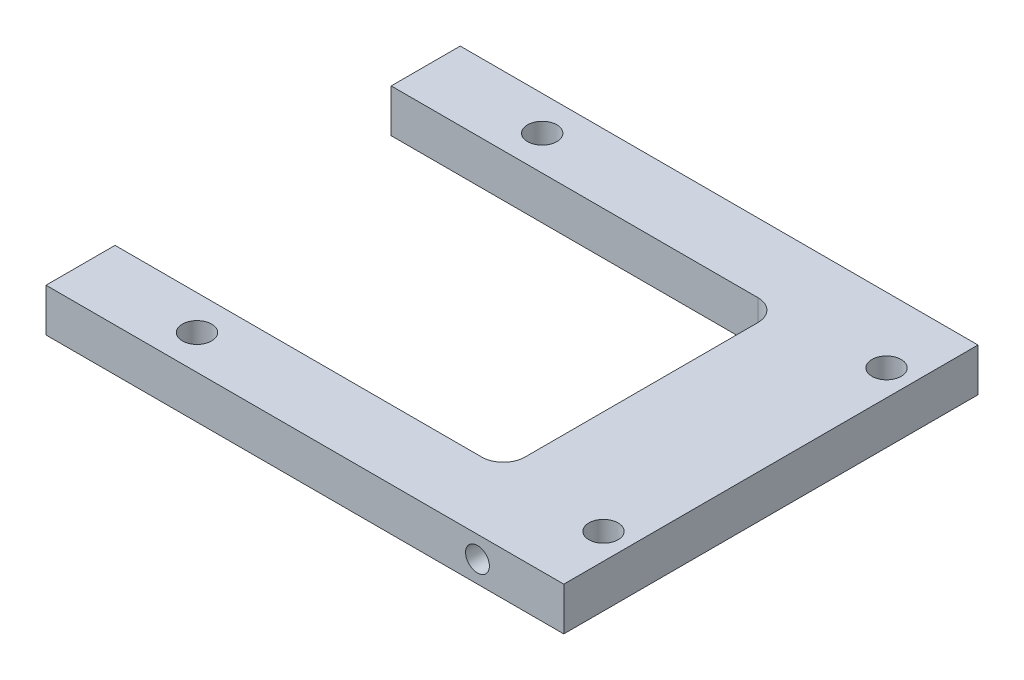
ISO-10303-21;
HEADER;
FILE_DESCRIPTION(('STEP AP214'),'2;1');
FILE_NAME('part.step','',(''),(''),'','','');
FILE_SCHEMA(('AUTOMOTIVE_DESIGN { 1 0 10303 214 1 1 1 1 }'));
ENDSEC;
DATA;
#1=APPLICATION_CONTEXT('core data for automotive mechanical design processes');
#2=APPLICATION_PROTOCOL_DEFINITION('international standard','automotive_design',2000,#1);
#3=PRODUCT_CONTEXT('',#1,'mechanical');
#4=PRODUCT('Part','Part','',(#3));
#5=PRODUCT_RELATED_PRODUCT_CATEGORY('part','',(#4));
#6=PRODUCT_DEFINITION_FORMATION('','',#4);
#7=PRODUCT_DEFINITION_CONTEXT('part definition',#1,'design');
#8=PRODUCT_DEFINITION('design','',#6,#7);
#9=PRODUCT_DEFINITION_SHAPE('','',#8);
#10=(LENGTH_UNIT() NAMED_UNIT(*) SI_UNIT(.MILLI.,.METRE.));
#11=(NAMED_UNIT(*) PLANE_ANGLE_UNIT() SI_UNIT($,.RADIAN.));
#12=(NAMED_UNIT(*) SI_UNIT($,.STERADIAN.) SOLID_ANGLE_UNIT());
#13=UNCERTAINTY_MEASURE_WITH_UNIT(LENGTH_MEASURE(1.E-05),#10,'distance_accuracy_value','');
#14=(GEOMETRIC_REPRESENTATION_CONTEXT(3) GLOBAL_UNCERTAINTY_ASSIGNED_CONTEXT((#13)) GLOBAL_UNIT_ASSIGNED_CONTEXT((#10,
#11,#12)) REPRESENTATION_CONTEXT('',''));
#15=CARTESIAN_POINT('',(0.,0.,0.));
#16=DIRECTION('',(0.,0.,1.));
#17=DIRECTION('',(1.,0.,0.));
#18=AXIS2_PLACEMENT_3D('',#15,#16,#17);
#19=CARTESIAN_POINT('',(-43.7302590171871,6.35,-31.8783006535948));
#20=DIRECTION('',(1.,0.,0.));
#21=DIRECTION('',(0.,0.,-1.));
#22=AXIS2_PLACEMENT_3D('',#19,#20,#21);
#23=PLANE('',#22);
#24=DIRECTION('',(0.,0.,1.));
#25=VECTOR('',#24,1.);
#26=CARTESIAN_POINT('',(-43.7302590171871,0.,-31.8783006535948));
#27=LINE('',#26,#25);
#28=CARTESIAN_POINT('',(-43.7302590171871,0.,-31.8783006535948));
#29=VERTEX_POINT('',#28);
#30=CARTESIAN_POINT('',(-43.7302590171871,0.,-21.7183006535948));
#31=VERTEX_POINT('',#30);
#32=EDGE_CURVE('E151',#29,#31,#27,.T.);
#33=ORIENTED_EDGE('',*,*,#32,.T.);
#34=DIRECTION('',(0.,-1.,0.));
#35=VECTOR('',#34,1.);
#36=CARTESIAN_POINT('',(-43.7302590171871,136.525,-21.7183006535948));
#37=LINE('',#36,#35);
#38=CARTESIAN_POINT('',(-43.7302590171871,6.34999999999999,-21.7183006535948));
#39=VERTEX_POINT('',#38);
#40=EDGE_CURVE('E118',#39,#31,#37,.T.);
#41=ORIENTED_EDGE('',*,*,#40,.F.);
#42=DIRECTION('',(0.,0.,1.));
#43=VECTOR('',#42,1.);
#44=CARTESIAN_POINT('',(-43.7302590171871,6.35,-31.8783006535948));
#45=LINE('',#44,#43);
#46=CARTESIAN_POINT('',(-43.7302590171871,6.35,-31.8783006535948));
#47=VERTEX_POINT('',#46);
#48=EDGE_CURVE('E134',#47,#39,#45,.T.);
#49=ORIENTED_EDGE('',*,*,#48,.F.);
#50=DIRECTION('',(0.,-1.,0.));
#51=VECTOR('',#50,1.);
#52=CARTESIAN_POINT('',(-43.7302590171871,6.35,-31.8783006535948));
#53=LINE('',#52,#51);
#54=EDGE_CURVE('E150',#47,#29,#53,.T.);
#55=ORIENTED_EDGE('',*,*,#54,.T.);
#56=EDGE_LOOP('',(#33,#41,#49,#55));
#57=FACE_BOUND('',#56,.T.);
#58=ADVANCED_FACE('F32',(#57),#23,.F.);
#59=CARTESIAN_POINT('',(-43.7302590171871,6.34999999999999,18.9216993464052));
#60=VERTEX_POINT('',#59);
#61=CARTESIAN_POINT('',(-43.7302590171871,6.35,29.0816993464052));
#62=VERTEX_POINT('',#61);
#63=EDGE_CURVE('E123',#60,#62,#45,.T.);
#64=ORIENTED_EDGE('',*,*,#63,.F.);
#65=DIRECTION('',(0.,-1.,0.));
#66=VECTOR('',#65,1.);
#67=CARTESIAN_POINT('',(-43.7302590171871,136.525,18.9216993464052));
#68=LINE('',#67,#66);
#69=CARTESIAN_POINT('',(-43.7302590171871,0.,18.9216993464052));
#70=VERTEX_POINT('',#69);
#71=EDGE_CURVE('E107',#60,#70,#68,.T.);
#72=ORIENTED_EDGE('',*,*,#71,.T.);
#73=CARTESIAN_POINT('',(-43.7302590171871,0.,29.0816993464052));
#74=VERTEX_POINT('',#73);
#75=EDGE_CURVE('E155',#70,#74,#27,.T.);
#76=ORIENTED_EDGE('',*,*,#75,.T.);
#77=DIRECTION('',(0.,-1.,0.));
#78=VECTOR('',#77,1.);
#79=CARTESIAN_POINT('',(-43.7302590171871,6.35,29.0816993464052));
#80=LINE('',#79,#78);
#81=EDGE_CURVE('E133',#62,#74,#80,.T.);
#82=ORIENTED_EDGE('',*,*,#81,.F.);
#83=EDGE_LOOP('',(#64,#72,#76,#82));
#84=FACE_BOUND('',#83,.T.);
#85=ADVANCED_FACE('F131',(#84),#23,.F.);
#86=CARTESIAN_POINT('',(-43.7302590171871,6.35,29.0816993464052));
#87=DIRECTION('',(0.,0.,-1.));
#88=DIRECTION('',(-1.,0.,0.));
#89=AXIS2_PLACEMENT_3D('',#86,#87,#88);
#90=PLANE('',#89);
#91=CARTESIAN_POINT('',(19.7697409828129,3.175,29.0816993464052));
#92=DIRECTION('',(0.,0.,1.));
#93=DIRECTION('',(1.,0.,0.));
#94=AXIS2_PLACEMENT_3D('',#91,#92,#93);
#95=CIRCLE('',#94,1.7526);
#96=CARTESIAN_POINT('',(21.5223409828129,3.175,29.0816993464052));
#97=VERTEX_POINT('',#96);
#98=EDGE_CURVE('E360',#97,#97,#95,.T.);
#99=ORIENTED_EDGE('',*,*,#98,.F.);
#100=EDGE_LOOP('',(#99));
#101=FACE_BOUND('',#100,.T.);
#102=DIRECTION('',(1.,0.,0.));
#103=VECTOR('',#102,1.);
#104=CARTESIAN_POINT('',(-43.7302590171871,0.,29.0816993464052));
#105=LINE('',#104,#103);
#106=CARTESIAN_POINT('',(32.4697409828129,0.,29.0816993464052));
#107=VERTEX_POINT('',#106);
#108=EDGE_CURVE('E154',#74,#107,#105,.T.);
#109=ORIENTED_EDGE('',*,*,#108,.T.);
#110=DIRECTION('',(0.,-1.,0.));
#111=VECTOR('',#110,1.);
#112=CARTESIAN_POINT('',(32.4697409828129,6.35,29.0816993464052));
#113=LINE('',#112,#111);
#114=CARTESIAN_POINT('',(32.4697409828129,6.35,29.0816993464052));
#115=VERTEX_POINT('',#114);
#116=EDGE_CURVE('E163',#115,#107,#113,.T.);
#117=ORIENTED_EDGE('',*,*,#116,.F.);
#118=DIRECTION('',(1.,0.,0.));
#119=VECTOR('',#118,1.);
#120=CARTESIAN_POINT('',(-43.7302590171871,6.35,29.0816993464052));
#121=LINE('',#120,#119);
#122=EDGE_CURVE('E138',#62,#115,#121,.T.);
#123=ORIENTED_EDGE('',*,*,#122,.F.);
#124=ORIENTED_EDGE('',*,*,#81,.T.);
#125=EDGE_LOOP('',(#109,#117,#123,#124));
#126=FACE_BOUND('',#125,.T.);
#127=ADVANCED_FACE('F204',(#101,#126),#90,.F.);
#128=CARTESIAN_POINT('',(32.4697409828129,6.35,-31.8783006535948));
#129=DIRECTION('',(-1.,0.,0.));
#130=DIRECTION('',(0.,0.,1.));
#131=AXIS2_PLACEMENT_3D('',#128,#129,#130);
#132=PLANE('',#131);
#133=DIRECTION('',(0.,0.,-1.));
#134=VECTOR('',#133,1.);
#135=CARTESIAN_POINT('',(32.4697409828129,0.,-31.8783006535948));
#136=LINE('',#135,#134);
#137=CARTESIAN_POINT('',(32.4697409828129,0.,-31.8783006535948));
#138=VERTEX_POINT('',#137);
#139=EDGE_CURVE('E139',#107,#138,#136,.T.);
#140=ORIENTED_EDGE('',*,*,#139,.T.);
#141=DIRECTION('',(0.,-1.,0.));
#142=VECTOR('',#141,1.);
#143=CARTESIAN_POINT('',(32.4697409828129,6.35,-31.8783006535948));
#144=LINE('',#143,#142);
#145=CARTESIAN_POINT('',(32.4697409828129,6.35,-31.8783006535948));
#146=VERTEX_POINT('',#145);
#147=EDGE_CURVE('E160',#146,#138,#144,.T.);
#148=ORIENTED_EDGE('',*,*,#147,.F.);
#149=DIRECTION('',(0.,0.,-1.));
#150=VECTOR('',#149,1.);
#151=CARTESIAN_POINT('',(32.4697409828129,6.35,-31.8783006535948));
#152=LINE('',#151,#150);
#153=EDGE_CURVE('E146',#115,#146,#152,.T.);
#154=ORIENTED_EDGE('',*,*,#153,.F.);
#155=ORIENTED_EDGE('',*,*,#116,.T.);
#156=EDGE_LOOP('',(#140,#148,#154,#155));
#157=FACE_BOUND('',#156,.T.);
#158=ADVANCED_FACE('F208',(#157),#132,.F.);
#159=CARTESIAN_POINT('',(-43.7302590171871,6.35,-31.8783006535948));
#160=DIRECTION('',(0.,0.,1.));
#161=DIRECTION('',(1.,0.,0.));
#162=AXIS2_PLACEMENT_3D('',#159,#160,#161);
#163=PLANE('',#162);
#164=DIRECTION('',(-1.,0.,0.));
#165=VECTOR('',#164,1.);
#166=CARTESIAN_POINT('',(-43.7302590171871,0.,-31.8783006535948));
#167=LINE('',#166,#165);
#168=EDGE_CURVE('E135',#138,#29,#167,.T.);
#169=ORIENTED_EDGE('',*,*,#168,.T.);
#170=ORIENTED_EDGE('',*,*,#54,.F.);
#171=DIRECTION('',(-1.,0.,0.));
#172=VECTOR('',#171,1.);
#173=CARTESIAN_POINT('',(-43.7302590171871,6.35,-31.8783006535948));
#174=LINE('',#173,#172);
#175=EDGE_CURVE('E148',#146,#47,#174,.T.);
#176=ORIENTED_EDGE('',*,*,#175,.F.);
#177=ORIENTED_EDGE('',*,*,#147,.T.);
#178=EDGE_LOOP('',(#169,#170,#176,#177));
#179=FACE_BOUND('',#178,.T.);
#180=ADVANCED_FACE('F212',(#179),#163,.F.);
#181=CARTESIAN_POINT('',(-43.7302590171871,6.35,29.0816993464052));
#182=DIRECTION('',(0.,1.,0.));
#183=DIRECTION('',(0.,0.,1.));
#184=AXIS2_PLACEMENT_3D('',#181,#182,#183);
#185=PLANE('',#184);
#186=DIRECTION('',(-1.,0.,0.));
#187=VECTOR('',#186,1.);
#188=CARTESIAN_POINT('',(-43.7302590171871,6.35,-21.7183006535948));
#189=LINE('',#188,#187);
#190=CARTESIAN_POINT('',(10.2447409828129,6.35,-21.7183006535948));
#191=VERTEX_POINT('',#190);
#192=EDGE_CURVE('E358',#191,#39,#189,.T.);
#193=ORIENTED_EDGE('',*,*,#192,.F.);
#194=CARTESIAN_POINT('',(10.2447409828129,6.34999999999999,-18.5433006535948));
#195=DIRECTION('',(0.,1.,0.));
#196=DIRECTION('',(0.,0.,1.));
#197=AXIS2_PLACEMENT_3D('',#194,#195,#196);
#198=CIRCLE('',#197,3.175);
#199=CARTESIAN_POINT('',(13.4197409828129,6.35,-18.5433006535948));
#200=VERTEX_POINT('',#199);
#201=EDGE_CURVE('E11',#191,#200,#198,.F.);
#202=ORIENTED_EDGE('',*,*,#201,.T.);
#203=DIRECTION('',(0.,0.,-1.));
#204=VECTOR('',#203,1.);
#205=CARTESIAN_POINT('',(13.4197409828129,6.35,29.0816993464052));
#206=LINE('',#205,#204);
#207=CARTESIAN_POINT('',(13.4197409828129,6.35,15.7466993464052));
#208=VERTEX_POINT('',#207);
#209=EDGE_CURVE('E128',#208,#200,#206,.T.);
#210=ORIENTED_EDGE('',*,*,#209,.F.);
#211=CARTESIAN_POINT('',(10.2447409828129,6.34999999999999,15.7466993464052));
#212=DIRECTION('',(0.,1.,0.));
#213=DIRECTION('',(0.,0.,1.));
#214=AXIS2_PLACEMENT_3D('',#211,#212,#213);
#215=CIRCLE('',#214,3.175);
#216=CARTESIAN_POINT('',(10.2447409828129,6.35,18.9216993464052));
#217=VERTEX_POINT('',#216);
#218=EDGE_CURVE('E127',#208,#217,#215,.F.);
#219=ORIENTED_EDGE('',*,*,#218,.T.);
#220=DIRECTION('',(1.,0.,0.));
#221=VECTOR('',#220,1.);
#222=CARTESIAN_POINT('',(-43.7302590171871,6.35,18.9216993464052));
#223=LINE('',#222,#221);
#224=EDGE_CURVE('E111',#60,#217,#223,.T.);
#225=ORIENTED_EDGE('',*,*,#224,.F.);
#226=ORIENTED_EDGE('',*,*,#63,.T.);
#227=ORIENTED_EDGE('',*,*,#122,.T.);
#228=ORIENTED_EDGE('',*,*,#153,.T.);
#229=ORIENTED_EDGE('',*,*,#175,.T.);
#230=ORIENTED_EDGE('',*,*,#48,.T.);
#231=EDGE_LOOP('',(#193,#202,#210,#219,#225,#226,#227,#228,#229,#230));
#232=FACE_BOUND('',#231,.T.);
#233=CARTESIAN_POINT('',(28.6597409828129,6.35,-22.2263006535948));
#234=DIRECTION('',(0.,1.,0.));
#235=DIRECTION('',(0.,0.,-1.));
#236=AXIS2_PLACEMENT_3D('',#233,#234,#235);
#237=CIRCLE('',#236,2.15265);
#238=CARTESIAN_POINT('',(28.6597409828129,6.35,-24.3789506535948));
#239=VERTEX_POINT('',#238);
#240=EDGE_CURVE('E367',#239,#239,#237,.T.);
#241=ORIENTED_EDGE('',*,*,#240,.F.);
#242=EDGE_LOOP('',(#241));
#243=FACE_BOUND('',#242,.T.);
#244=CARTESIAN_POINT('',(28.6597409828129,6.35,19.4296993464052));
#245=DIRECTION('',(0.,1.,0.));
#246=DIRECTION('',(0.,0.,1.));
#247=AXIS2_PLACEMENT_3D('',#244,#245,#246);
#248=CIRCLE('',#247,2.15265);
#249=CARTESIAN_POINT('',(28.6597409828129,6.35,21.5823493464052));
#250=VERTEX_POINT('',#249);
#251=EDGE_CURVE('E373',#250,#250,#248,.T.);
#252=ORIENTED_EDGE('',*,*,#251,.F.);
#253=EDGE_LOOP('',(#252));
#254=FACE_BOUND('',#253,.T.);
#255=CARTESIAN_POINT('',(-26.5852590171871,6.35,-26.7983006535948));
#256=DIRECTION('',(0.,1.,0.));
#257=DIRECTION('',(0.,0.,-1.));
#258=AXIS2_PLACEMENT_3D('',#255,#256,#257);
#259=CIRCLE('',#258,2.15265);
#260=CARTESIAN_POINT('',(-26.5852590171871,6.35,-28.9509506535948));
#261=VERTEX_POINT('',#260);
#262=EDGE_CURVE('E379',#261,#261,#259,.T.);
#263=ORIENTED_EDGE('',*,*,#262,.F.);
#264=EDGE_LOOP('',(#263));
#265=FACE_BOUND('',#264,.T.);
#266=CARTESIAN_POINT('',(-26.5852590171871,6.35,24.0016993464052));
#267=DIRECTION('',(0.,1.,0.));
#268=DIRECTION('',(0.,0.,1.));
#269=AXIS2_PLACEMENT_3D('',#266,#267,#268);
#270=CIRCLE('',#269,2.15265);
#271=CARTESIAN_POINT('',(-26.5852590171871,6.35,26.1543493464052));
#272=VERTEX_POINT('',#271);
#273=EDGE_CURVE('E143',#272,#272,#270,.T.);
#274=ORIENTED_EDGE('',*,*,#273,.F.);
#275=EDGE_LOOP('',(#274));
#276=FACE_BOUND('',#275,.T.);
#277=ADVANCED_FACE('F121',(#232,#243,#254,#265,#276),#185,.T.);
#278=CARTESIAN_POINT('',(-43.7302590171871,0.,29.0816993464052));
#279=DIRECTION('',(0.,1.,0.));
#280=DIRECTION('',(0.,0.,1.));
#281=AXIS2_PLACEMENT_3D('',#278,#279,#280);
#282=PLANE('',#281);
#283=CARTESIAN_POINT('',(28.6597409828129,0.,-22.2263006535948));
#284=DIRECTION('',(0.,1.,0.));
#285=DIRECTION('',(0.,0.,-1.));
#286=AXIS2_PLACEMENT_3D('',#283,#284,#285);
#287=CIRCLE('',#286,2.15265);
#288=CARTESIAN_POINT('',(28.6597409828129,0.,-24.3789506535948));
#289=VERTEX_POINT('',#288);
#290=EDGE_CURVE('E370',#289,#289,#287,.T.);
#291=ORIENTED_EDGE('',*,*,#290,.T.);
#292=EDGE_LOOP('',(#291));
#293=FACE_BOUND('',#292,.T.);
#294=CARTESIAN_POINT('',(28.6597409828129,0.,19.4296993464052));
#295=DIRECTION('',(0.,1.,0.));
#296=DIRECTION('',(0.,0.,1.));
#297=AXIS2_PLACEMENT_3D('',#294,#295,#296);
#298=CIRCLE('',#297,2.15265);
#299=CARTESIAN_POINT('',(28.6597409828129,0.,21.5823493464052));
#300=VERTEX_POINT('',#299);
#301=EDGE_CURVE('E376',#300,#300,#298,.T.);
#302=ORIENTED_EDGE('',*,*,#301,.T.);
#303=EDGE_LOOP('',(#302));
#304=FACE_BOUND('',#303,.T.);
#305=CARTESIAN_POINT('',(-26.5852590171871,0.,-26.7983006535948));
#306=DIRECTION('',(0.,1.,0.));
#307=DIRECTION('',(0.,0.,-1.));
#308=AXIS2_PLACEMENT_3D('',#305,#306,#307);
#309=CIRCLE('',#308,2.15265);
#310=CARTESIAN_POINT('',(-26.5852590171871,0.,-28.9509506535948));
#311=VERTEX_POINT('',#310);
#312=EDGE_CURVE('E382',#311,#311,#309,.T.);
#313=ORIENTED_EDGE('',*,*,#312,.T.);
#314=EDGE_LOOP('',(#313));
#315=FACE_BOUND('',#314,.T.);
#316=CARTESIAN_POINT('',(-26.5852590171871,0.,24.0016993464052));
#317=DIRECTION('',(0.,1.,0.));
#318=DIRECTION('',(0.,0.,1.));
#319=AXIS2_PLACEMENT_3D('',#316,#317,#318);
#320=CIRCLE('',#319,2.15265);
#321=CARTESIAN_POINT('',(-26.5852590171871,0.,26.1543493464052));
#322=VERTEX_POINT('',#321);
#323=EDGE_CURVE('E386',#322,#322,#320,.T.);
#324=ORIENTED_EDGE('',*,*,#323,.T.);
#325=EDGE_LOOP('',(#324));
#326=FACE_BOUND('',#325,.T.);
#327=DIRECTION('',(1.,0.,0.));
#328=VECTOR('',#327,1.);
#329=CARTESIAN_POINT('',(-43.7302590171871,0.,18.9216993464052));
#330=LINE('',#329,#328);
#331=CARTESIAN_POINT('',(10.2447409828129,0.,18.9216993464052));
#332=VERTEX_POINT('',#331);
#333=EDGE_CURVE('E114',#70,#332,#330,.T.);
#334=ORIENTED_EDGE('',*,*,#333,.T.);
#335=CARTESIAN_POINT('',(10.2447409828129,0.,15.7466993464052));
#336=DIRECTION('',(0.,1.,0.));
#337=DIRECTION('',(0.,0.,1.));
#338=AXIS2_PLACEMENT_3D('',#335,#336,#337);
#339=CIRCLE('',#338,3.175);
#340=CARTESIAN_POINT('',(13.4197409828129,0.,15.7466993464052));
#341=VERTEX_POINT('',#340);
#342=EDGE_CURVE('E180',#332,#341,#339,.T.);
#343=ORIENTED_EDGE('',*,*,#342,.T.);
#344=DIRECTION('',(0.,0.,-1.));
#345=VECTOR('',#344,1.);
#346=CARTESIAN_POINT('',(13.4197409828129,0.,29.0816993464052));
#347=LINE('',#346,#345);
#348=CARTESIAN_POINT('',(13.4197409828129,0.,-18.5433006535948));
#349=VERTEX_POINT('',#348);
#350=EDGE_CURVE('E168',#341,#349,#347,.T.);
#351=ORIENTED_EDGE('',*,*,#350,.T.);
#352=CARTESIAN_POINT('',(10.2447409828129,0.,-18.5433006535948));
#353=DIRECTION('',(0.,1.,0.));
#354=DIRECTION('',(0.,0.,1.));
#355=AXIS2_PLACEMENT_3D('',#352,#353,#354);
#356=CIRCLE('',#355,3.175);
#357=CARTESIAN_POINT('',(10.2447409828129,0.,-21.7183006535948));
#358=VERTEX_POINT('',#357);
#359=EDGE_CURVE('E40',#349,#358,#356,.T.);
#360=ORIENTED_EDGE('',*,*,#359,.T.);
#361=DIRECTION('',(-1.,0.,0.));
#362=VECTOR('',#361,1.);
#363=CARTESIAN_POINT('',(-43.7302590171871,0.,-21.7183006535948));
#364=LINE('',#363,#362);
#365=EDGE_CURVE('E170',#358,#31,#364,.T.);
#366=ORIENTED_EDGE('',*,*,#365,.T.);
#367=ORIENTED_EDGE('',*,*,#32,.F.);
#368=ORIENTED_EDGE('',*,*,#168,.F.);
#369=ORIENTED_EDGE('',*,*,#139,.F.);
#370=ORIENTED_EDGE('',*,*,#108,.F.);
#371=ORIENTED_EDGE('',*,*,#75,.F.);
#372=EDGE_LOOP('',(#334,#343,#351,#360,#366,#367,#368,#369,#370,#371));
#373=FACE_BOUND('',#372,.T.);
#374=ADVANCED_FACE('F183',(#293,#304,#315,#326,#373),#282,.F.);
#375=CARTESIAN_POINT('',(-26.5852590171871,0.,24.0016993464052));
#376=DIRECTION('',(0.,1.,0.));
#377=DIRECTION('',(0.,0.,1.));
#378=AXIS2_PLACEMENT_3D('',#375,#376,#377);
#379=CYLINDRICAL_SURFACE('',#378,2.15265);
#380=ORIENTED_EDGE('',*,*,#323,.F.);
#381=EDGE_LOOP('',(#380));
#382=FACE_BOUND('',#381,.T.);
#383=ORIENTED_EDGE('',*,*,#273,.T.);
#384=EDGE_LOOP('',(#383));
#385=FACE_BOUND('',#384,.T.);
#386=ADVANCED_FACE('F219',(#382,#385),#379,.F.);
#387=CARTESIAN_POINT('',(-26.5852590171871,0.,-26.7983006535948));
#388=DIRECTION('',(0.,1.,0.));
#389=DIRECTION('',(0.,0.,1.));
#390=AXIS2_PLACEMENT_3D('',#387,#388,#389);
#391=CYLINDRICAL_SURFACE('',#390,2.15265);
#392=ORIENTED_EDGE('',*,*,#312,.F.);
#393=EDGE_LOOP('',(#392));
#394=FACE_BOUND('',#393,.T.);
#395=ORIENTED_EDGE('',*,*,#262,.T.);
#396=EDGE_LOOP('',(#395));
#397=FACE_BOUND('',#396,.T.);
#398=ADVANCED_FACE('F225',(#394,#397),#391,.F.);
#399=CARTESIAN_POINT('',(28.6597409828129,0.,19.4296993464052));
#400=DIRECTION('',(0.,1.,0.));
#401=DIRECTION('',(0.,0.,1.));
#402=AXIS2_PLACEMENT_3D('',#399,#400,#401);
#403=CYLINDRICAL_SURFACE('',#402,2.15265);
#404=ORIENTED_EDGE('',*,*,#301,.F.);
#405=EDGE_LOOP('',(#404));
#406=FACE_BOUND('',#405,.T.);
#407=ORIENTED_EDGE('',*,*,#251,.T.);
#408=EDGE_LOOP('',(#407));
#409=FACE_BOUND('',#408,.T.);
#410=ADVANCED_FACE('F229',(#406,#409),#403,.F.);
#411=CARTESIAN_POINT('',(28.6597409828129,0.,-22.2263006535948));
#412=DIRECTION('',(0.,1.,0.));
#413=DIRECTION('',(0.,0.,1.));
#414=AXIS2_PLACEMENT_3D('',#411,#412,#413);
#415=CYLINDRICAL_SURFACE('',#414,2.15265);
#416=ORIENTED_EDGE('',*,*,#290,.F.);
#417=EDGE_LOOP('',(#416));
#418=FACE_BOUND('',#417,.T.);
#419=ORIENTED_EDGE('',*,*,#240,.T.);
#420=EDGE_LOOP('',(#419));
#421=FACE_BOUND('',#420,.T.);
#422=ADVANCED_FACE('F233',(#418,#421),#415,.F.);
#423=CARTESIAN_POINT('',(19.7697409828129,3.175,16.3816993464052));
#424=DIRECTION('',(0.,0.,1.));
#425=DIRECTION('',(1.,0.,0.));
#426=AXIS2_PLACEMENT_3D('',#423,#424,#425);
#427=CYLINDRICAL_SURFACE('',#426,1.7526);
#428=CARTESIAN_POINT('',(19.7697409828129,3.175,16.3816993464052));
#429=DIRECTION('',(0.,0.,1.));
#430=DIRECTION('',(1.,0.,0.));
#431=AXIS2_PLACEMENT_3D('',#428,#429,#430);
#432=CIRCLE('',#431,1.7526);
#433=CARTESIAN_POINT('',(21.5223409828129,3.175,16.3816993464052));
#434=VERTEX_POINT('',#433);
#435=EDGE_CURVE('E364',#434,#434,#432,.T.);
#436=ORIENTED_EDGE('',*,*,#435,.F.);
#437=EDGE_LOOP('',(#436));
#438=FACE_BOUND('',#437,.T.);
#439=ORIENTED_EDGE('',*,*,#98,.T.);
#440=EDGE_LOOP('',(#439));
#441=FACE_BOUND('',#440,.T.);
#442=ADVANCED_FACE('F237',(#438,#441),#427,.F.);
#443=CARTESIAN_POINT('',(19.7697409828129,3.175,16.3816993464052));
#444=DIRECTION('',(0.,0.,1.));
#445=DIRECTION('',(1.,0.,0.));
#446=AXIS2_PLACEMENT_3D('',#443,#444,#445);
#447=PLANE('',#446);
#448=ORIENTED_EDGE('',*,*,#435,.T.);
#449=EDGE_LOOP('',(#448));
#450=FACE_BOUND('',#449,.T.);
#451=ADVANCED_FACE('F241',(#450),#447,.T.);
#452=CARTESIAN_POINT('',(-43.7302590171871,136.525,-21.7183006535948));
#453=DIRECTION('',(0.,0.,-1.));
#454=DIRECTION('',(-1.,0.,0.));
#455=AXIS2_PLACEMENT_3D('',#452,#453,#454);
#456=PLANE('',#455);
#457=ORIENTED_EDGE('',*,*,#365,.F.);
#458=DIRECTION('',(0.,-1.,0.));
#459=VECTOR('',#458,1.);
#460=CARTESIAN_POINT('',(10.2447409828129,6.34999999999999,-21.7183006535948));
#461=LINE('',#460,#459);
#462=EDGE_CURVE('E53',#358,#191,#461,.F.);
#463=ORIENTED_EDGE('',*,*,#462,.T.);
#464=ORIENTED_EDGE('',*,*,#192,.T.);
#465=ORIENTED_EDGE('',*,*,#40,.T.);
#466=EDGE_LOOP('',(#457,#463,#464,#465));
#467=FACE_BOUND('',#466,.T.);
#468=ADVANCED_FACE('F245',(#467),#456,.F.);
#469=CARTESIAN_POINT('',(13.4197409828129,136.525,-21.7183006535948));
#470=DIRECTION('',(1.,0.,0.));
#471=DIRECTION('',(0.,0.,-1.));
#472=AXIS2_PLACEMENT_3D('',#469,#470,#471);
#473=PLANE('',#472);
#474=ORIENTED_EDGE('',*,*,#350,.F.);
#475=DIRECTION('',(0.,-1.,0.));
#476=VECTOR('',#475,1.);
#477=CARTESIAN_POINT('',(13.4197409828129,6.34999999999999,15.7466993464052));
#478=LINE('',#477,#476);
#479=EDGE_CURVE('E177',#341,#208,#478,.F.);
#480=ORIENTED_EDGE('',*,*,#479,.T.);
#481=ORIENTED_EDGE('',*,*,#209,.T.);
#482=DIRECTION('',(0.,-1.,0.));
#483=VECTOR('',#482,1.);
#484=CARTESIAN_POINT('',(13.4197409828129,0.,-18.5433006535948));
#485=LINE('',#484,#483);
#486=EDGE_CURVE('E174',#200,#349,#485,.T.);
#487=ORIENTED_EDGE('',*,*,#486,.T.);
#488=EDGE_LOOP('',(#474,#480,#481,#487));
#489=FACE_BOUND('',#488,.T.);
#490=ADVANCED_FACE('F187',(#489),#473,.F.);
#491=CARTESIAN_POINT('',(13.4197409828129,136.525,18.9216993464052));
#492=DIRECTION('',(0.,0.,1.));
#493=DIRECTION('',(1.,0.,0.));
#494=AXIS2_PLACEMENT_3D('',#491,#492,#493);
#495=PLANE('',#494);
#496=ORIENTED_EDGE('',*,*,#224,.T.);
#497=DIRECTION('',(0.,-1.,0.));
#498=VECTOR('',#497,1.);
#499=CARTESIAN_POINT('',(10.2447409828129,0.,18.9216993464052));
#500=LINE('',#499,#498);
#501=EDGE_CURVE('E172',#217,#332,#500,.T.);
#502=ORIENTED_EDGE('',*,*,#501,.T.);
#503=ORIENTED_EDGE('',*,*,#333,.F.);
#504=ORIENTED_EDGE('',*,*,#71,.F.);
#505=EDGE_LOOP('',(#496,#502,#503,#504));
#506=FACE_BOUND('',#505,.T.);
#507=ADVANCED_FACE('F109',(#506),#495,.F.);
#508=CARTESIAN_POINT('',(10.2447409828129,136.525,15.7466993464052));
#509=DIRECTION('',(0.,1.,0.));
#510=DIRECTION('',(0.,0.,1.));
#511=AXIS2_PLACEMENT_3D('',#508,#509,#510);
#512=CYLINDRICAL_SURFACE('',#511,3.175);
#513=ORIENTED_EDGE('',*,*,#218,.F.);
#514=ORIENTED_EDGE('',*,*,#479,.F.);
#515=ORIENTED_EDGE('',*,*,#342,.F.);
#516=ORIENTED_EDGE('',*,*,#501,.F.);
#517=EDGE_LOOP('',(#513,#514,#515,#516));
#518=FACE_BOUND('',#517,.T.);
#519=ADVANCED_FACE('F190',(#518),#512,.F.);
#520=CARTESIAN_POINT('',(10.2447409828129,136.525,-18.5433006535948));
#521=DIRECTION('',(0.,1.,0.));
#522=DIRECTION('',(0.,0.,1.));
#523=AXIS2_PLACEMENT_3D('',#520,#521,#522);
#524=CYLINDRICAL_SURFACE('',#523,3.175);
#525=ORIENTED_EDGE('',*,*,#201,.F.);
#526=ORIENTED_EDGE('',*,*,#462,.F.);
#527=ORIENTED_EDGE('',*,*,#359,.F.);
#528=ORIENTED_EDGE('',*,*,#486,.F.);
#529=EDGE_LOOP('',(#525,#526,#527,#528));
#530=FACE_BOUND('',#529,.T.);
#531=ADVANCED_FACE('F34',(#530),#524,.F.);
#532=CLOSED_SHELL('',(#58,#85,#127,#158,#180,#277,#374,#386,#398,#410,#422,#442,#451,#468,#490,
#507,#519,#531));
#533=MANIFOLD_SOLID_BREP('B2',#532);
#534=ADVANCED_BREP_SHAPE_REPRESENTATION('',(#18,#533),#14);
#535=SHAPE_DEFINITION_REPRESENTATION(#9,#534);
ENDSEC;
END-ISO-10303-21;
